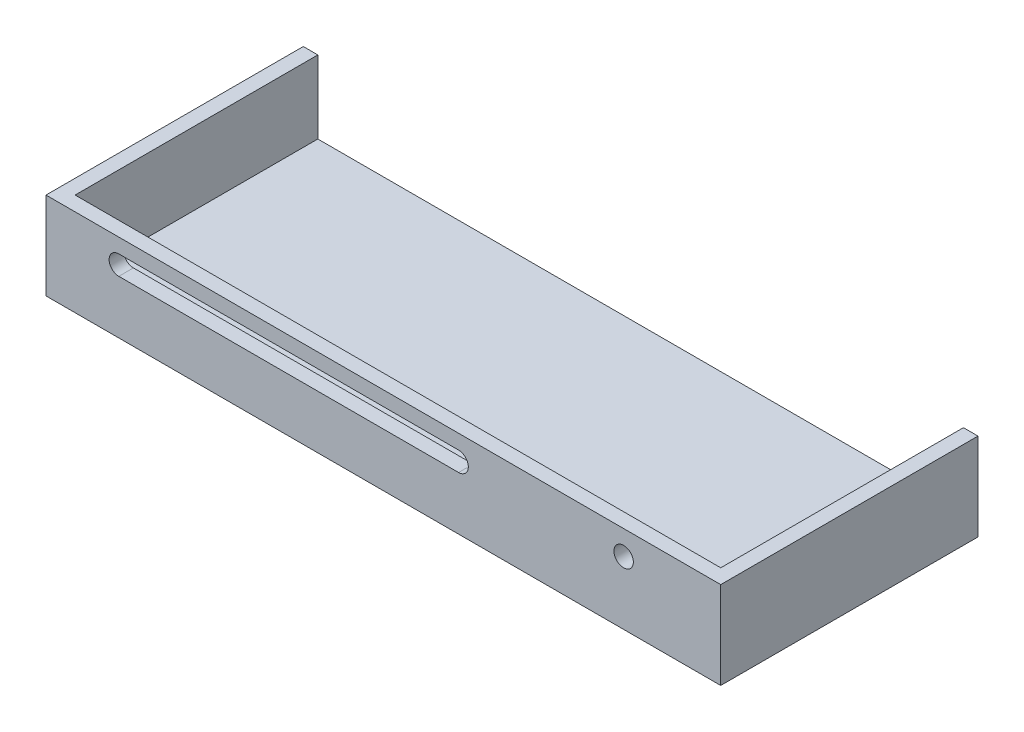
from build123d import *

# Parameters (mm, degrees)
BOSS_EXTRUDE1_DEPTH = 139
SKETCH5_R           = 2
CUT_EXTRUDE1_DEPTH  = 148.549991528
SKETCH6_W           = 3
SKETCH6_H           = 35
BOSS_EXTRUDE2_DEPTH = 35
SKETCH7_W           = 133
SKETCH7_H           = 35
BOSS_EXTRUDE3_DEPTH = 5
SKETCH8_W           = 133
SKETCH8_H           = 35
CUT_EXTRUDE2_DEPTH  = 20
SKETCH9_W           = 3
SKETCH9_H           = 12
BOSS_EXTRUDE4_DEPTH = 25
SKETCH10_W          = 133
SKETCH10_H          = 50
BOSS_EXTRUDE5_DEPTH = 20
SKETCH11_W          = 139
SKETCH11_H          = 53
CUT_EXTRUDE3_DEPTH  = 20


with BuildPart() as part:
    # Sketch3 → Boss-Extrude1 (new body)
    with BuildSketch(Plane(origin=(0, 0, 0), x_dir=(0, 0, -1), z_dir=(1, 0, 0))):
        Polygon((-34.8080918, 35), (-34.8080918, 10), (-22.8080918, 10), (-22.8080918, 35), (-19.8080918, 35), (-19.8080918, 0), (15.1919082, 0), (15.1919082, -3), (-29.8080918, -3), (-37.8080918, -3), (-37.8080918, 0), (-37.8080918, 35), align=None)
    extrude(amount=BOSS_EXTRUDE1_DEPTH)

    # Sketch5 → Cut-Extrude1 (cut, through all)
    with BuildSketch(Plane(origin=(0, 0, 19.8080918), x_dir=(-1, 0, 0), z_dir=(0, 0, -1))):
        with Locations(Location((-119, 30, 0), (0, 0, 90))):
            Circle(SKETCH5_R)
        with BuildLine():
            Line((-85, 32), (-15, 32))
            ThreePointArc((-15, 32), (-13, 30), (-15, 28))
            Line((-15, 28), (-85, 28))
            ThreePointArc((-85, 28), (-87, 30), (-85, 32))
        make_face()
    extrude(amount=-CUT_EXTRUDE1_DEPTH, mode=Mode.SUBTRACT)

    # Sketch6 → Boss-Extrude2 (add)
    with BuildSketch(Plane(origin=(0, 0, 0), x_dir=(1, 0, 0), z_dir=(0, 1, 0))):
        with Locations((1.5, -2.3080918)):
            Rectangle(SKETCH6_W, SKETCH6_H)
        with Locations((137.5, -2.3080918)):
            Rectangle(SKETCH6_W, SKETCH6_H)
    extrude(amount=BOSS_EXTRUDE2_DEPTH)

    # Sketch7 → Boss-Extrude3 (add)
    with BuildSketch(Plane(origin=(0, 0, 19.8080918), x_dir=(-1, 0, 0), z_dir=(0, 0, -1))):
        with Locations((-69.5, 17.5)):
            Rectangle(SKETCH7_W, SKETCH7_H)
    extrude(amount=BOSS_EXTRUDE3_DEPTH)

    # Sketch8 → Cut-Extrude2 (cut)
    with BuildSketch(Plane(origin=(0, 0, 14.8080918), x_dir=(-1, 0, 0), z_dir=(0, 0, -1))):
        with Locations((-69.5, 17.5)):
            Rectangle(SKETCH8_W, SKETCH8_H)
    extrude(amount=-CUT_EXTRUDE2_DEPTH, mode=Mode.SUBTRACT)

    # Sketch9 → Boss-Extrude4 (add)
    with BuildSketch(Plane(origin=(0, 10, 0), x_dir=(1, 0, 0), z_dir=(0, 1, 0))):
        with Locations((137.5, -28.8080918)):
            Rectangle(SKETCH9_W, SKETCH9_H)
        with Locations((1.5, -28.8080918)):
            Rectangle(SKETCH9_W, SKETCH9_H)
    extrude(amount=BOSS_EXTRUDE4_DEPTH)

    # Sketch10 → Boss-Extrude5 (add)
    with BuildSketch(Plane(origin=(0, 0, 0), x_dir=(1, 0, 0), z_dir=(0, 1, 0))):
        with Locations((69.5, -9.8080918)):
            Rectangle(SKETCH10_W, SKETCH10_H)
    extrude(amount=BOSS_EXTRUDE5_DEPTH)

    # Sketch11 → Cut-Extrude3 (cut)
    with BuildSketch(Plane.XZ.offset(3)):
        with Locations((69.5, 11.3080918)):
            Rectangle(SKETCH11_W, SKETCH11_H)
    extrude(amount=-CUT_EXTRUDE3_DEPTH, mode=Mode.SUBTRACT)


solid = part.part
